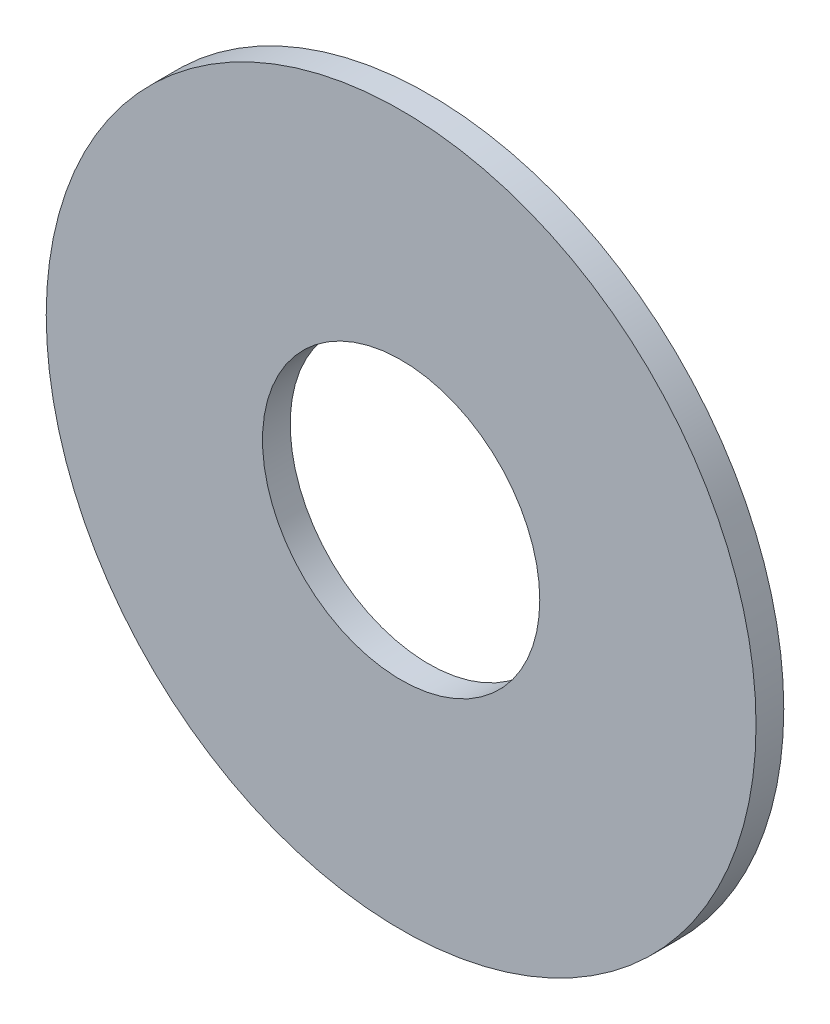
from build123d import *

# Parameters (mm, degrees)
ESQUISSE1_R      = 64
ESQUISSE1_R_2    = 25
EXTRUSION1_DEPTH = 5


with BuildPart() as part:
    # Esquisse1 → Extrusion1 (new body)
    with BuildSketch(Plane.XY):
        Circle(ESQUISSE1_R)
        Circle(ESQUISSE1_R_2, mode=Mode.SUBTRACT)
    extrude(amount=EXTRUSION1_DEPTH)


solid = part.part
